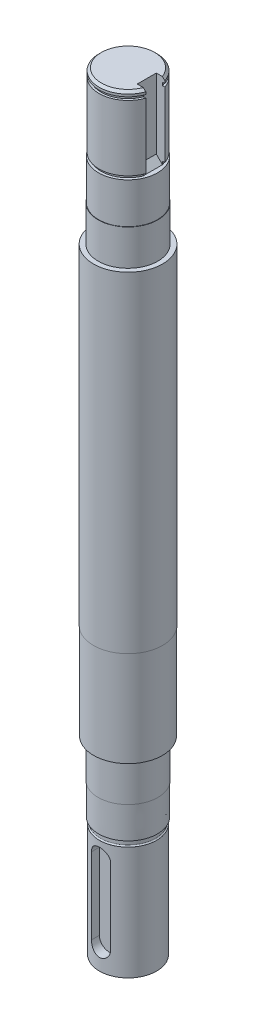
ISO-10303-21;
HEADER;
FILE_DESCRIPTION(('STEP AP214'),'2;1');
FILE_NAME('part.step','',(''),(''),'','','');
FILE_SCHEMA(('AUTOMOTIVE_DESIGN { 1 0 10303 214 1 1 1 1 }'));
ENDSEC;
DATA;
#1=APPLICATION_CONTEXT('core data for automotive mechanical design processes');
#2=APPLICATION_PROTOCOL_DEFINITION('international standard','automotive_design',2000,#1);
#3=PRODUCT_CONTEXT('',#1,'mechanical');
#4=PRODUCT('Part','Part','',(#3));
#5=PRODUCT_RELATED_PRODUCT_CATEGORY('part','',(#4));
#6=PRODUCT_DEFINITION_FORMATION('','',#4);
#7=PRODUCT_DEFINITION_CONTEXT('part definition',#1,'design');
#8=PRODUCT_DEFINITION('design','',#6,#7);
#9=PRODUCT_DEFINITION_SHAPE('','',#8);
#10=(LENGTH_UNIT() NAMED_UNIT(*) SI_UNIT(.MILLI.,.METRE.));
#11=(NAMED_UNIT(*) PLANE_ANGLE_UNIT() SI_UNIT($,.RADIAN.));
#12=(NAMED_UNIT(*) SI_UNIT($,.STERADIAN.) SOLID_ANGLE_UNIT());
#13=UNCERTAINTY_MEASURE_WITH_UNIT(LENGTH_MEASURE(1.E-05),#10,'distance_accuracy_value','');
#14=(GEOMETRIC_REPRESENTATION_CONTEXT(3) GLOBAL_UNCERTAINTY_ASSIGNED_CONTEXT((#13)) GLOBAL_UNIT_ASSIGNED_CONTEXT((#10,
#11,#12)) REPRESENTATION_CONTEXT('',''));
#15=CARTESIAN_POINT('',(0.,0.,0.));
#16=DIRECTION('',(0.,0.,1.));
#17=DIRECTION('',(1.,0.,0.));
#18=AXIS2_PLACEMENT_3D('',#15,#16,#17);
#19=CARTESIAN_POINT('',(12.,50.,0.));
#20=DIRECTION('',(0.,-1.,0.));
#21=DIRECTION('',(0.,0.,-1.));
#22=AXIS2_PLACEMENT_3D('',#19,#20,#21);
#23=PLANE('',#22);
#24=CARTESIAN_POINT('',(0.,50.,0.));
#25=DIRECTION('',(0.,-1.,0.));
#26=DIRECTION('',(0.,0.,-1.));
#27=AXIS2_PLACEMENT_3D('',#24,#25,#26);
#28=CIRCLE('',#27,12.35);
#29=CARTESIAN_POINT('',(0.,50.,-12.35));
#30=VERTEX_POINT('',#29);
#31=EDGE_CURVE('E295',#30,#30,#28,.T.);
#32=ORIENTED_EDGE('',*,*,#31,.T.);
#33=EDGE_LOOP('',(#32));
#34=FACE_BOUND('',#33,.T.);
#35=CARTESIAN_POINT('',(0.,50.,0.));
#36=DIRECTION('',(0.,-1.,0.));
#37=DIRECTION('',(0.,0.,-1.));
#38=AXIS2_PLACEMENT_3D('',#35,#36,#37);
#39=CIRCLE('',#38,11.99);
#40=CARTESIAN_POINT('',(0.,50.,-11.99));
#41=VERTEX_POINT('',#40);
#42=EDGE_CURVE('E219',#41,#41,#39,.T.);
#43=ORIENTED_EDGE('',*,*,#42,.F.);
#44=EDGE_LOOP('',(#43));
#45=FACE_BOUND('',#44,.T.);
#46=ADVANCED_FACE('F33',(#34,#45),#23,.T.);
#47=CARTESIAN_POINT('',(0.,50.,0.));
#48=DIRECTION('',(0.,-1.,0.));
#49=DIRECTION('',(0.,0.,-1.));
#50=AXIS2_PLACEMENT_3D('',#47,#48,#49);
#51=CONICAL_SURFACE('',#50,12.35,0.000548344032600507);
#52=CARTESIAN_POINT('',(0.,63.3,0.));
#53=DIRECTION('',(0.,-1.,0.));
#54=DIRECTION('',(0.,0.,-1.));
#55=AXIS2_PLACEMENT_3D('',#52,#53,#54);
#56=CIRCLE('',#55,12.3427070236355);
#57=CARTESIAN_POINT('',(0.,63.3,-12.3427070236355));
#58=VERTEX_POINT('',#57);
#59=EDGE_CURVE('E292',#58,#58,#56,.T.);
#60=ORIENTED_EDGE('',*,*,#59,.T.);
#61=EDGE_LOOP('',(#60));
#62=FACE_BOUND('',#61,.T.);
#63=ORIENTED_EDGE('',*,*,#31,.F.);
#64=EDGE_LOOP('',(#63));
#65=FACE_BOUND('',#64,.T.);
#66=ADVANCED_FACE('F376',(#62,#65),#51,.T.);
#67=CARTESIAN_POINT('',(12.5,63.3,0.));
#68=DIRECTION('',(0.,-1.,0.));
#69=DIRECTION('',(0.,0.,-1.));
#70=AXIS2_PLACEMENT_3D('',#67,#68,#69);
#71=PLANE('',#70);
#72=CARTESIAN_POINT('',(0.,63.3,0.));
#73=DIRECTION('',(0.,-1.,0.));
#74=DIRECTION('',(0.,0.,-1.));
#75=AXIS2_PLACEMENT_3D('',#72,#73,#74);
#76=CIRCLE('',#75,12.5);
#77=CARTESIAN_POINT('',(0.,63.3,-12.5));
#78=VERTEX_POINT('',#77);
#79=EDGE_CURVE('E289',#78,#78,#76,.T.);
#80=ORIENTED_EDGE('',*,*,#79,.T.);
#81=EDGE_LOOP('',(#80));
#82=FACE_BOUND('',#81,.T.);
#83=ORIENTED_EDGE('',*,*,#59,.F.);
#84=EDGE_LOOP('',(#83));
#85=FACE_BOUND('',#84,.T.);
#86=ADVANCED_FACE('F381',(#82,#85),#71,.T.);
#87=CARTESIAN_POINT('',(0.,326.056951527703,0.));
#88=DIRECTION('',(0.,-1.,0.));
#89=DIRECTION('',(0.,0.,-1.));
#90=AXIS2_PLACEMENT_3D('',#87,#88,#89);
#91=CYLINDRICAL_SURFACE('',#90,12.5);
#92=CARTESIAN_POINT('',(0.,79.5,0.));
#93=DIRECTION('',(0.,-1.,0.));
#94=DIRECTION('',(0.,0.,-1.));
#95=AXIS2_PLACEMENT_3D('',#92,#93,#94);
#96=CIRCLE('',#95,12.5);
#97=CARTESIAN_POINT('',(0.,79.5,-12.5));
#98=VERTEX_POINT('',#97);
#99=EDGE_CURVE('E286',#98,#98,#96,.T.);
#100=ORIENTED_EDGE('',*,*,#99,.T.);
#101=EDGE_LOOP('',(#100));
#102=FACE_BOUND('',#101,.T.);
#103=ORIENTED_EDGE('',*,*,#79,.F.);
#104=EDGE_LOOP('',(#103));
#105=FACE_BOUND('',#104,.T.);
#106=ADVANCED_FACE('F388',(#102,#105),#91,.T.);
#107=CARTESIAN_POINT('',(12.5,79.5,0.));
#108=DIRECTION('',(0.,-1.,0.));
#109=DIRECTION('',(0.,0.,-1.));
#110=AXIS2_PLACEMENT_3D('',#107,#108,#109);
#111=PLANE('',#110);
#112=CARTESIAN_POINT('',(0.,79.5,0.));
#113=DIRECTION('',(0.,-1.,0.));
#114=DIRECTION('',(0.,0.,-1.));
#115=AXIS2_PLACEMENT_3D('',#112,#113,#114);
#116=CIRCLE('',#115,14.4);
#117=CARTESIAN_POINT('',(0.,79.5,-14.4));
#118=VERTEX_POINT('',#117);
#119=EDGE_CURVE('E283',#118,#118,#116,.T.);
#120=ORIENTED_EDGE('',*,*,#119,.T.);
#121=EDGE_LOOP('',(#120));
#122=FACE_BOUND('',#121,.T.);
#123=ORIENTED_EDGE('',*,*,#99,.F.);
#124=EDGE_LOOP('',(#123));
#125=FACE_BOUND('',#124,.T.);
#126=ADVANCED_FACE('F392',(#122,#125),#111,.T.);
#127=CARTESIAN_POINT('',(0.,326.056951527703,0.));
#128=DIRECTION('',(0.,-1.,0.));
#129=DIRECTION('',(0.,0.,-1.));
#130=AXIS2_PLACEMENT_3D('',#127,#128,#129);
#131=CYLINDRICAL_SURFACE('',#130,14.4);
#132=CARTESIAN_POINT('',(0.,119.5,0.));
#133=DIRECTION('',(0.,-1.,0.));
#134=DIRECTION('',(0.,0.,-1.));
#135=AXIS2_PLACEMENT_3D('',#132,#133,#134);
#136=CIRCLE('',#135,14.4);
#137=CARTESIAN_POINT('',(0.,119.5,-14.4));
#138=VERTEX_POINT('',#137);
#139=EDGE_CURVE('E280',#138,#138,#136,.T.);
#140=ORIENTED_EDGE('',*,*,#139,.T.);
#141=EDGE_LOOP('',(#140));
#142=FACE_BOUND('',#141,.T.);
#143=ORIENTED_EDGE('',*,*,#119,.F.);
#144=EDGE_LOOP('',(#143));
#145=FACE_BOUND('',#144,.T.);
#146=ADVANCED_FACE('F396',(#142,#145),#131,.T.);
#147=CARTESIAN_POINT('',(14.5,119.5,0.));
#148=DIRECTION('',(0.,-1.,0.));
#149=DIRECTION('',(0.,0.,-1.));
#150=AXIS2_PLACEMENT_3D('',#147,#148,#149);
#151=PLANE('',#150);
#152=CARTESIAN_POINT('',(0.,119.5,0.));
#153=DIRECTION('',(0.,-1.,0.));
#154=DIRECTION('',(0.,0.,-1.));
#155=AXIS2_PLACEMENT_3D('',#152,#153,#154);
#156=CIRCLE('',#155,14.5);
#157=CARTESIAN_POINT('',(0.,119.5,-14.5));
#158=VERTEX_POINT('',#157);
#159=EDGE_CURVE('E277',#158,#158,#156,.T.);
#160=ORIENTED_EDGE('',*,*,#159,.T.);
#161=EDGE_LOOP('',(#160));
#162=FACE_BOUND('',#161,.T.);
#163=ORIENTED_EDGE('',*,*,#139,.F.);
#164=EDGE_LOOP('',(#163));
#165=FACE_BOUND('',#164,.T.);
#166=ADVANCED_FACE('F400',(#162,#165),#151,.T.);
#167=CARTESIAN_POINT('',(0.,326.056951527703,0.));
#168=DIRECTION('',(0.,-1.,0.));
#169=DIRECTION('',(0.,0.,-1.));
#170=AXIS2_PLACEMENT_3D('',#167,#168,#169);
#171=CYLINDRICAL_SURFACE('',#170,14.5);
#172=CARTESIAN_POINT('',(0.,258.,0.));
#173=DIRECTION('',(0.,-1.,0.));
#174=DIRECTION('',(0.,0.,-1.));
#175=AXIS2_PLACEMENT_3D('',#172,#173,#174);
#176=CIRCLE('',#175,14.5000000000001);
#177=CARTESIAN_POINT('',(0.,258.,-14.5000000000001));
#178=VERTEX_POINT('',#177);
#179=EDGE_CURVE('E274',#178,#178,#176,.T.);
#180=ORIENTED_EDGE('',*,*,#179,.T.);
#181=EDGE_LOOP('',(#180));
#182=FACE_BOUND('',#181,.T.);
#183=ORIENTED_EDGE('',*,*,#159,.F.);
#184=EDGE_LOOP('',(#183));
#185=FACE_BOUND('',#184,.T.);
#186=ADVANCED_FACE('F404',(#182,#185),#171,.T.);
#187=CARTESIAN_POINT('',(14.5000000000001,258.,0.));
#188=DIRECTION('',(0.,1.,0.));
#189=DIRECTION('',(0.,0.,1.));
#190=AXIS2_PLACEMENT_3D('',#187,#188,#189);
#191=PLANE('',#190);
#192=CARTESIAN_POINT('',(0.,258.,0.));
#193=DIRECTION('',(0.,-1.,0.));
#194=DIRECTION('',(0.,0.,-1.));
#195=AXIS2_PLACEMENT_3D('',#192,#193,#194);
#196=CIRCLE('',#195,12.5);
#197=CARTESIAN_POINT('',(0.,258.,-12.5));
#198=VERTEX_POINT('',#197);
#199=EDGE_CURVE('E271',#198,#198,#196,.T.);
#200=ORIENTED_EDGE('',*,*,#199,.T.);
#201=EDGE_LOOP('',(#200));
#202=FACE_BOUND('',#201,.T.);
#203=ORIENTED_EDGE('',*,*,#179,.F.);
#204=EDGE_LOOP('',(#203));
#205=FACE_BOUND('',#204,.T.);
#206=ADVANCED_FACE('F408',(#202,#205),#191,.T.);
#207=CARTESIAN_POINT('',(0.,326.056951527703,0.));
#208=DIRECTION('',(0.,-1.,0.));
#209=DIRECTION('',(0.,0.,-1.));
#210=AXIS2_PLACEMENT_3D('',#207,#208,#209);
#211=CYLINDRICAL_SURFACE('',#210,12.5);
#212=CARTESIAN_POINT('',(0.,273.,0.));
#213=DIRECTION('',(0.,-1.,0.));
#214=DIRECTION('',(0.,0.,-1.));
#215=AXIS2_PLACEMENT_3D('',#212,#213,#214);
#216=CIRCLE('',#215,12.5);
#217=CARTESIAN_POINT('',(0.,273.,-12.5));
#218=VERTEX_POINT('',#217);
#219=EDGE_CURVE('E268',#218,#218,#216,.T.);
#220=ORIENTED_EDGE('',*,*,#219,.T.);
#221=EDGE_LOOP('',(#220));
#222=FACE_BOUND('',#221,.T.);
#223=ORIENTED_EDGE('',*,*,#199,.F.);
#224=EDGE_LOOP('',(#223));
#225=FACE_BOUND('',#224,.T.);
#226=ADVANCED_FACE('F412',(#222,#225),#211,.T.);
#227=CARTESIAN_POINT('',(12.5,273.,0.));
#228=DIRECTION('',(0.,1.,0.));
#229=DIRECTION('',(0.,0.,1.));
#230=AXIS2_PLACEMENT_3D('',#227,#228,#229);
#231=PLANE('',#230);
#232=CARTESIAN_POINT('',(0.,273.,0.));
#233=DIRECTION('',(0.,-1.,0.));
#234=DIRECTION('',(0.,0.,-1.));
#235=AXIS2_PLACEMENT_3D('',#232,#233,#234);
#236=CIRCLE('',#235,12.35);
#237=CARTESIAN_POINT('',(0.,273.,-12.35));
#238=VERTEX_POINT('',#237);
#239=EDGE_CURVE('E265',#238,#238,#236,.T.);
#240=ORIENTED_EDGE('',*,*,#239,.T.);
#241=EDGE_LOOP('',(#240));
#242=FACE_BOUND('',#241,.T.);
#243=ORIENTED_EDGE('',*,*,#219,.F.);
#244=EDGE_LOOP('',(#243));
#245=FACE_BOUND('',#244,.T.);
#246=ADVANCED_FACE('F416',(#242,#245),#231,.T.);
#247=CARTESIAN_POINT('',(0.,326.056951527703,0.));
#248=DIRECTION('',(0.,-1.,0.));
#249=DIRECTION('',(0.,0.,-1.));
#250=AXIS2_PLACEMENT_3D('',#247,#248,#249);
#251=CYLINDRICAL_SURFACE('',#250,12.35);
#252=CARTESIAN_POINT('',(0.,290.,0.));
#253=DIRECTION('',(0.,-1.,0.));
#254=DIRECTION('',(0.,0.,-1.));
#255=AXIS2_PLACEMENT_3D('',#252,#253,#254);
#256=CIRCLE('',#255,12.35);
#257=CARTESIAN_POINT('',(0.,290.,-12.35));
#258=VERTEX_POINT('',#257);
#259=EDGE_CURVE('E262',#258,#258,#256,.T.);
#260=ORIENTED_EDGE('',*,*,#259,.T.);
#261=EDGE_LOOP('',(#260));
#262=FACE_BOUND('',#261,.T.);
#263=ORIENTED_EDGE('',*,*,#239,.F.);
#264=EDGE_LOOP('',(#263));
#265=FACE_BOUND('',#264,.T.);
#266=ADVANCED_FACE('F420',(#262,#265),#251,.T.);
#267=CARTESIAN_POINT('',(12.35,290.,0.));
#268=DIRECTION('',(0.,1.,0.));
#269=DIRECTION('',(0.,0.,1.));
#270=AXIS2_PLACEMENT_3D('',#267,#268,#269);
#271=PLANE('',#270);
#272=DIRECTION('',(1.,0.,0.));
#273=VECTOR('',#272,1.);
#274=CARTESIAN_POINT('',(7.85,290.,-4.));
#275=LINE('',#274,#273);
#276=CARTESIAN_POINT('',(10.45,290.,-4.));
#277=VERTEX_POINT('',#276);
#278=CARTESIAN_POINT('',(10.5226729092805,290.,-4.));
#279=VERTEX_POINT('',#278);
#280=EDGE_CURVE('E168',#277,#279,#275,.T.);
#281=ORIENTED_EDGE('',*,*,#280,.F.);
#282=DIRECTION('',(0.,0.,1.));
#283=VECTOR('',#282,1.);
#284=CARTESIAN_POINT('',(10.45,290.,4.));
#285=LINE('',#284,#283);
#286=CARTESIAN_POINT('',(10.45,290.,4.));
#287=VERTEX_POINT('',#286);
#288=EDGE_CURVE('E41',#277,#287,#285,.T.);
#289=ORIENTED_EDGE('',*,*,#288,.T.);
#290=DIRECTION('',(1.,0.,0.));
#291=VECTOR('',#290,1.);
#292=CARTESIAN_POINT('',(7.85,290.,4.));
#293=LINE('',#292,#291);
#294=CARTESIAN_POINT('',(10.5226729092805,290.,4.));
#295=VERTEX_POINT('',#294);
#296=EDGE_CURVE('E166',#287,#295,#293,.T.);
#297=ORIENTED_EDGE('',*,*,#296,.T.);
#298=CARTESIAN_POINT('',(0.,290.,0.));
#299=DIRECTION('',(0.,-1.,0.));
#300=DIRECTION('',(0.,0.,-1.));
#301=AXIS2_PLACEMENT_3D('',#298,#299,#300);
#302=CIRCLE('',#301,11.2572929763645);
#303=EDGE_CURVE('E259',#295,#279,#302,.T.);
#304=ORIENTED_EDGE('',*,*,#303,.T.);
#305=EDGE_LOOP('',(#281,#289,#297,#304));
#306=FACE_BOUND('',#305,.T.);
#307=ORIENTED_EDGE('',*,*,#259,.F.);
#308=EDGE_LOOP('',(#307));
#309=FACE_BOUND('',#308,.T.);
#310=ADVANCED_FACE('F424',(#306,#309),#271,.T.);
#311=CARTESIAN_POINT('',(0.,326.056951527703,0.));
#312=DIRECTION('',(0.,-1.,0.));
#313=DIRECTION('',(0.,0.,-1.));
#314=AXIS2_PLACEMENT_3D('',#311,#312,#313);
#315=CYLINDRICAL_SURFACE('',#314,11.2572929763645);
#316=DIRECTION('',(0.,-1.,0.));
#317=VECTOR('',#316,1.);
#318=CARTESIAN_POINT('',(10.5226729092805,326.056951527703,-4.));
#319=LINE('',#318,#317);
#320=CARTESIAN_POINT('',(10.5226729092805,291.3,-4.));
#321=VERTEX_POINT('',#320);
#322=EDGE_CURVE('E201',#279,#321,#319,.F.);
#323=ORIENTED_EDGE('',*,*,#322,.F.);
#324=ORIENTED_EDGE('',*,*,#303,.F.);
#325=DIRECTION('',(0.,-1.,0.));
#326=VECTOR('',#325,1.);
#327=CARTESIAN_POINT('',(10.5226729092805,326.056951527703,4.));
#328=LINE('',#327,#326);
#329=CARTESIAN_POINT('',(10.5226729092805,291.3,4.));
#330=VERTEX_POINT('',#329);
#331=EDGE_CURVE('E186',#330,#295,#328,.T.);
#332=ORIENTED_EDGE('',*,*,#331,.F.);
#333=CARTESIAN_POINT('',(0.,291.3,0.));
#334=DIRECTION('',(0.,-1.,0.));
#335=DIRECTION('',(0.,0.,-1.));
#336=AXIS2_PLACEMENT_3D('',#333,#334,#335);
#337=CIRCLE('',#336,11.2572929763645);
#338=EDGE_CURVE('E256',#330,#321,#337,.T.);
#339=ORIENTED_EDGE('',*,*,#338,.T.);
#340=EDGE_LOOP('',(#323,#324,#332,#339));
#341=FACE_BOUND('',#340,.T.);
#342=ADVANCED_FACE('F428',(#341),#315,.T.);
#343=CARTESIAN_POINT('',(11.2572929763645,291.3,0.));
#344=DIRECTION('',(0.,-1.,0.));
#345=DIRECTION('',(0.,0.,-1.));
#346=AXIS2_PLACEMENT_3D('',#343,#344,#345);
#347=PLANE('',#346);
#348=DIRECTION('',(1.,0.,0.));
#349=VECTOR('',#348,1.);
#350=CARTESIAN_POINT('',(11.2572929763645,291.3,-4.));
#351=LINE('',#350,#349);
#352=CARTESIAN_POINT('',(11.472684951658,291.3,-4.));
#353=VERTEX_POINT('',#352);
#354=EDGE_CURVE('E199',#321,#353,#351,.T.);
#355=ORIENTED_EDGE('',*,*,#354,.F.);
#356=ORIENTED_EDGE('',*,*,#338,.F.);
#357=DIRECTION('',(-1.,0.,0.));
#358=VECTOR('',#357,1.);
#359=CARTESIAN_POINT('',(11.2572929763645,291.3,4.));
#360=LINE('',#359,#358);
#361=CARTESIAN_POINT('',(11.472684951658,291.3,4.));
#362=VERTEX_POINT('',#361);
#363=EDGE_CURVE('E184',#362,#330,#360,.T.);
#364=ORIENTED_EDGE('',*,*,#363,.F.);
#365=CARTESIAN_POINT('',(0.,291.3,0.));
#366=DIRECTION('',(0.,-1.,0.));
#367=DIRECTION('',(0.,0.,-1.));
#368=AXIS2_PLACEMENT_3D('',#365,#366,#367);
#369=CIRCLE('',#368,12.15);
#370=EDGE_CURVE('E253',#362,#353,#369,.T.);
#371=ORIENTED_EDGE('',*,*,#370,.T.);
#372=EDGE_LOOP('',(#355,#356,#364,#371));
#373=FACE_BOUND('',#372,.T.);
#374=ADVANCED_FACE('F431',(#373),#347,.T.);
#375=CARTESIAN_POINT('',(0.,326.056951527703,0.));
#376=DIRECTION('',(0.,-1.,0.));
#377=DIRECTION('',(0.,0.,-1.));
#378=AXIS2_PLACEMENT_3D('',#375,#376,#377);
#379=CYLINDRICAL_SURFACE('',#378,12.15);
#380=DIRECTION('',(0.,-1.,0.));
#381=VECTOR('',#380,1.);
#382=CARTESIAN_POINT('',(11.472684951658,326.056951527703,-4.));
#383=LINE('',#382,#381);
#384=CARTESIAN_POINT('',(11.472684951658,318.7,-4.));
#385=VERTEX_POINT('',#384);
#386=EDGE_CURVE('E197',#353,#385,#383,.F.);
#387=ORIENTED_EDGE('',*,*,#386,.F.);
#388=ORIENTED_EDGE('',*,*,#370,.F.);
#389=DIRECTION('',(0.,-1.,0.));
#390=VECTOR('',#389,1.);
#391=CARTESIAN_POINT('',(11.472684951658,326.056951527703,4.));
#392=LINE('',#391,#390);
#393=CARTESIAN_POINT('',(11.472684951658,318.7,4.));
#394=VERTEX_POINT('',#393);
#395=EDGE_CURVE('E182',#394,#362,#392,.T.);
#396=ORIENTED_EDGE('',*,*,#395,.F.);
#397=CARTESIAN_POINT('',(0.,318.7,0.));
#398=DIRECTION('',(0.,-1.,0.));
#399=DIRECTION('',(0.,0.,-1.));
#400=AXIS2_PLACEMENT_3D('',#397,#398,#399);
#401=CIRCLE('',#400,12.15);
#402=EDGE_CURVE('E250',#394,#385,#401,.T.);
#403=ORIENTED_EDGE('',*,*,#402,.T.);
#404=EDGE_LOOP('',(#387,#388,#396,#403));
#405=FACE_BOUND('',#404,.T.);
#406=ADVANCED_FACE('F435',(#405),#379,.T.);
#407=CARTESIAN_POINT('',(11.25,318.7,0.));
#408=DIRECTION('',(0.,1.,0.));
#409=DIRECTION('',(0.,0.,1.));
#410=AXIS2_PLACEMENT_3D('',#407,#408,#409);
#411=PLANE('',#410);
#412=DIRECTION('',(-1.,0.,0.));
#413=VECTOR('',#412,1.);
#414=CARTESIAN_POINT('',(11.25,318.7,-4.));
#415=LINE('',#414,#413);
#416=CARTESIAN_POINT('',(10.5148704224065,318.7,-4.));
#417=VERTEX_POINT('',#416);
#418=EDGE_CURVE('E195',#385,#417,#415,.T.);
#419=ORIENTED_EDGE('',*,*,#418,.F.);
#420=ORIENTED_EDGE('',*,*,#402,.F.);
#421=DIRECTION('',(1.,0.,0.));
#422=VECTOR('',#421,1.);
#423=CARTESIAN_POINT('',(11.25,318.7,4.));
#424=LINE('',#423,#422);
#425=CARTESIAN_POINT('',(10.5148704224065,318.7,4.));
#426=VERTEX_POINT('',#425);
#427=EDGE_CURVE('E180',#426,#394,#424,.T.);
#428=ORIENTED_EDGE('',*,*,#427,.F.);
#429=CARTESIAN_POINT('',(0.,318.7,0.));
#430=DIRECTION('',(0.,-1.,0.));
#431=DIRECTION('',(0.,0.,-1.));
#432=AXIS2_PLACEMENT_3D('',#429,#430,#431);
#433=CIRCLE('',#432,11.25);
#434=EDGE_CURVE('E247',#426,#417,#433,.T.);
#435=ORIENTED_EDGE('',*,*,#434,.T.);
#436=EDGE_LOOP('',(#419,#420,#428,#435));
#437=FACE_BOUND('',#436,.T.);
#438=ADVANCED_FACE('F439',(#437),#411,.T.);
#439=CARTESIAN_POINT('',(0.,326.056951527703,0.));
#440=DIRECTION('',(0.,-1.,0.));
#441=DIRECTION('',(0.,0.,-1.));
#442=AXIS2_PLACEMENT_3D('',#439,#440,#441);
#443=CYLINDRICAL_SURFACE('',#442,11.25);
#444=DIRECTION('',(0.,-1.,0.));
#445=VECTOR('',#444,1.);
#446=CARTESIAN_POINT('',(10.5148704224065,326.056951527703,-4.));
#447=LINE('',#446,#445);
#448=CARTESIAN_POINT('',(10.5148704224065,320.,-4.));
#449=VERTEX_POINT('',#448);
#450=EDGE_CURVE('E193',#417,#449,#447,.F.);
#451=ORIENTED_EDGE('',*,*,#450,.F.);
#452=ORIENTED_EDGE('',*,*,#434,.F.);
#453=DIRECTION('',(0.,-1.,0.));
#454=VECTOR('',#453,1.);
#455=CARTESIAN_POINT('',(10.5148704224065,326.056951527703,4.));
#456=LINE('',#455,#454);
#457=CARTESIAN_POINT('',(10.5148704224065,320.,4.));
#458=VERTEX_POINT('',#457);
#459=EDGE_CURVE('E178',#458,#426,#456,.T.);
#460=ORIENTED_EDGE('',*,*,#459,.F.);
#461=CARTESIAN_POINT('',(0.,320.,0.));
#462=DIRECTION('',(0.,-1.,0.));
#463=DIRECTION('',(0.,0.,-1.));
#464=AXIS2_PLACEMENT_3D('',#461,#462,#463);
#465=CIRCLE('',#464,11.25);
#466=EDGE_CURVE('E244',#458,#449,#465,.T.);
#467=ORIENTED_EDGE('',*,*,#466,.T.);
#468=EDGE_LOOP('',(#451,#452,#460,#467));
#469=FACE_BOUND('',#468,.T.);
#470=ADVANCED_FACE('F443',(#469),#443,.T.);
#471=CARTESIAN_POINT('',(12.15,320.,0.));
#472=DIRECTION('',(0.,-1.,0.));
#473=DIRECTION('',(0.,0.,-1.));
#474=AXIS2_PLACEMENT_3D('',#471,#472,#473);
#475=PLANE('',#474);
#476=DIRECTION('',(1.,0.,0.));
#477=VECTOR('',#476,1.);
#478=CARTESIAN_POINT('',(12.15,320.,-4.));
#479=LINE('',#478,#477);
#480=CARTESIAN_POINT('',(11.472684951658,320.,-4.));
#481=VERTEX_POINT('',#480);
#482=EDGE_CURVE('E191',#449,#481,#479,.T.);
#483=ORIENTED_EDGE('',*,*,#482,.F.);
#484=ORIENTED_EDGE('',*,*,#466,.F.);
#485=DIRECTION('',(-1.,0.,0.));
#486=VECTOR('',#485,1.);
#487=CARTESIAN_POINT('',(12.15,320.,4.));
#488=LINE('',#487,#486);
#489=CARTESIAN_POINT('',(11.472684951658,320.,4.));
#490=VERTEX_POINT('',#489);
#491=EDGE_CURVE('E175',#490,#458,#488,.T.);
#492=ORIENTED_EDGE('',*,*,#491,.F.);
#493=CARTESIAN_POINT('',(0.,320.,0.));
#494=DIRECTION('',(0.,-1.,0.));
#495=DIRECTION('',(0.,0.,-1.));
#496=AXIS2_PLACEMENT_3D('',#493,#494,#495);
#497=CIRCLE('',#496,12.15);
#498=EDGE_CURVE('E241',#490,#481,#497,.T.);
#499=ORIENTED_EDGE('',*,*,#498,.T.);
#500=EDGE_LOOP('',(#483,#484,#492,#499));
#501=FACE_BOUND('',#500,.T.);
#502=ADVANCED_FACE('F447',(#501),#475,.T.);
#503=CARTESIAN_POINT('',(0.,326.056951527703,0.));
#504=DIRECTION('',(0.,-1.,0.));
#505=DIRECTION('',(0.,0.,-1.));
#506=AXIS2_PLACEMENT_3D('',#503,#504,#505);
#507=CYLINDRICAL_SURFACE('',#506,12.15);
#508=DIRECTION('',(0.,-1.,0.));
#509=VECTOR('',#508,1.);
#510=CARTESIAN_POINT('',(11.472684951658,326.056951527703,-4.));
#511=LINE('',#510,#509);
#512=CARTESIAN_POINT('',(11.472684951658,321.,-4.));
#513=VERTEX_POINT('',#512);
#514=EDGE_CURVE('E189',#481,#513,#511,.F.);
#515=ORIENTED_EDGE('',*,*,#514,.F.);
#516=ORIENTED_EDGE('',*,*,#498,.F.);
#517=DIRECTION('',(0.,-1.,0.));
#518=VECTOR('',#517,1.);
#519=CARTESIAN_POINT('',(11.472684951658,326.056951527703,4.));
#520=LINE('',#519,#518);
#521=CARTESIAN_POINT('',(11.472684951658,321.,4.));
#522=VERTEX_POINT('',#521);
#523=EDGE_CURVE('E173',#522,#490,#520,.T.);
#524=ORIENTED_EDGE('',*,*,#523,.F.);
#525=CARTESIAN_POINT('',(0.,321.,0.));
#526=DIRECTION('',(0.,1.,0.));
#527=DIRECTION('',(0.,0.,1.));
#528=AXIS2_PLACEMENT_3D('',#525,#526,#527);
#529=CIRCLE('',#528,12.15);
#530=EDGE_CURVE('E301',#522,#513,#529,.F.);
#531=ORIENTED_EDGE('',*,*,#530,.T.);
#532=EDGE_LOOP('',(#515,#516,#524,#531));
#533=FACE_BOUND('',#532,.T.);
#534=ADVANCED_FACE('F451',(#533),#507,.T.);
#535=CARTESIAN_POINT('',(12.15,322.,0.));
#536=DIRECTION('',(0.,1.,0.));
#537=DIRECTION('',(0.,0.,1.));
#538=AXIS2_PLACEMENT_3D('',#535,#536,#537);
#539=PLANE('',#538);
#540=DIRECTION('',(1.,0.,0.));
#541=VECTOR('',#540,1.);
#542=CARTESIAN_POINT('',(7.85,322.,-4.));
#543=LINE('',#542,#541);
#544=CARTESIAN_POINT('',(7.85,322.,-4.));
#545=VERTEX_POINT('',#544);
#546=CARTESIAN_POINT('',(10.4078095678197,322.,-4.));
#547=VERTEX_POINT('',#546);
#548=EDGE_CURVE('E176',#545,#547,#543,.T.);
#549=ORIENTED_EDGE('',*,*,#548,.T.);
#550=CARTESIAN_POINT('',(0.,322.,0.));
#551=DIRECTION('',(0.,1.,0.));
#552=DIRECTION('',(0.,0.,1.));
#553=AXIS2_PLACEMENT_3D('',#550,#551,#552);
#554=CIRCLE('',#553,11.15);
#555=CARTESIAN_POINT('',(10.4078095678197,322.,4.));
#556=VERTEX_POINT('',#555);
#557=EDGE_CURVE('E165',#547,#556,#554,.T.);
#558=ORIENTED_EDGE('',*,*,#557,.T.);
#559=DIRECTION('',(1.,0.,0.));
#560=VECTOR('',#559,1.);
#561=CARTESIAN_POINT('',(7.85,322.,4.));
#562=LINE('',#561,#560);
#563=CARTESIAN_POINT('',(7.85,322.,4.));
#564=VERTEX_POINT('',#563);
#565=EDGE_CURVE('E147',#564,#556,#562,.T.);
#566=ORIENTED_EDGE('',*,*,#565,.F.);
#567=DIRECTION('',(0.,0.,1.));
#568=VECTOR('',#567,1.);
#569=CARTESIAN_POINT('',(7.85,322.,4.));
#570=LINE('',#569,#568);
#571=EDGE_CURVE('E154',#545,#564,#570,.T.);
#572=ORIENTED_EDGE('',*,*,#571,.F.);
#573=EDGE_LOOP('',(#549,#558,#566,#572));
#574=FACE_BOUND('',#573,.T.);
#575=ADVANCED_FACE('F163',(#574),#539,.T.);
#576=CARTESIAN_POINT('',(0.,321.,0.));
#577=DIRECTION('',(0.,-1.,0.));
#578=DIRECTION('',(0.,0.,-1.));
#579=AXIS2_PLACEMENT_3D('',#576,#577,#578);
#580=CONICAL_SURFACE('',#579,12.15,0.785398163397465);
#581=CARTESIAN_POINT('',(16.720062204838,315.958127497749,-4.));
#582=CARTESIAN_POINT('',(16.2239323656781,316.440582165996,-4.));
#583=CARTESIAN_POINT('',(15.727275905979,316.92249878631,-4.));
#584=CARTESIAN_POINT('',(14.7324625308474,317.88471369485,-4.));
#585=CARTESIAN_POINT('',(14.2343057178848,318.365012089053,-4.));
#586=CARTESIAN_POINT('',(13.236269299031,319.32323347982,-4.));
#587=CARTESIAN_POINT('',(12.7363908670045,319.801157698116,-4.));
#588=CARTESIAN_POINT('',(11.733810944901,320.75411902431,-4.));
#589=CARTESIAN_POINT('',(11.2311092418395,321.229155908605,-4.));
#590=CARTESIAN_POINT('',(10.4738218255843,321.938700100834,-4.));
#591=CARTESIAN_POINT('',(10.2207427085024,322.174815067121,-4.));
#592=CARTESIAN_POINT('',(9.71334660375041,322.645708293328,-4.));
#593=CARTESIAN_POINT('',(9.45902962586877,322.880486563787,-4.));
#594=CARTESIAN_POINT('',(8.94891205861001,323.34833217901,-4.));
#595=CARTESIAN_POINT('',(8.69311175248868,323.581399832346,-4.));
#596=CARTESIAN_POINT('',(8.1795805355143,324.045417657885,-4.));
#597=CARTESIAN_POINT('',(7.92184956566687,324.2763677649,-4.));
#598=CARTESIAN_POINT('',(7.40373040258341,324.735676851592,-4.));
#599=CARTESIAN_POINT('',(7.14334031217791,324.964033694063,-4.));
#600=CARTESIAN_POINT('',(6.61937633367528,325.417035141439,-4.));
#601=CARTESIAN_POINT('',(6.35580272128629,325.641680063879,-4.));
#602=CARTESIAN_POINT('',(5.95714867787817,325.974880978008,-4.));
#603=CARTESIAN_POINT('',(5.8236715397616,326.085355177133,-4.));
#604=CARTESIAN_POINT('',(5.55546367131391,326.304766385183,-4.));
#605=CARTESIAN_POINT('',(5.42073297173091,326.413703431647,-4.));
#606=CARTESIAN_POINT('',(5.14976483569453,326.629772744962,-4.));
#607=CARTESIAN_POINT('',(5.01352697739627,326.736904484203,-4.));
#608=CARTESIAN_POINT('',(4.73929378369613,326.948916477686,-4.));
#609=CARTESIAN_POINT('',(4.60129830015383,327.05379654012,-4.));
#610=CARTESIAN_POINT('',(4.4622911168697,327.15733431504,-4.));
#611=B_SPLINE_CURVE_WITH_KNOTS('',3,(#581,#582,#583,#584,#585,#586,#587,#588,#589,#590,#591,
#592,#593,#594,#595,#596,#597,#598,#599,#600,#601,#602,#603,#604,#605,#606,#607,#608,#609,#610),
.UNSPECIFIED.,.F.,.F.,(4,2,2,2,2,2,2,2,2,2,2,2,2,2,4),(0.,2.07609728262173,4.15205585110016,
6.22680399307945,8.3017108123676,9.34006831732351,10.3784176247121,11.4165747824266,
12.4547637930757,13.4937540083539,14.5326548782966,15.0524402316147,15.5722128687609,
16.0921348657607,16.6121009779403),.UNSPECIFIED.);
#612=EDGE_CURVE('E356',#513,#547,#611,.T.);
#613=ORIENTED_EDGE('',*,*,#612,.F.);
#614=ORIENTED_EDGE('',*,*,#530,.F.);
#615=CARTESIAN_POINT('',(4.4622911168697,327.15733431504,4.));
#616=CARTESIAN_POINT('',(4.58005525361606,327.069628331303,4.));
#617=CARTESIAN_POINT('',(4.69708938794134,326.980951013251,4.));
#618=CARTESIAN_POINT('',(4.92986603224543,326.801929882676,4.));
#619=CARTESIAN_POINT('',(5.04560861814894,326.711586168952,4.));
#620=CARTESIAN_POINT('',(5.27595889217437,326.529518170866,4.));
#621=CARTESIAN_POINT('',(5.39056682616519,326.437794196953,4.));
#622=CARTESIAN_POINT('',(5.61881468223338,326.253147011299,4.));
#623=CARTESIAN_POINT('',(5.73245458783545,326.160223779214,4.));
#624=CARTESIAN_POINT('',(6.07198795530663,325.880016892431,4.));
#625=CARTESIAN_POINT('',(6.29661620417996,325.691199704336,4.));
#626=CARTESIAN_POINT('',(6.7432629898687,325.310485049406,4.));
#627=CARTESIAN_POINT('',(6.96528135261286,325.118587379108,4.));
#628=CARTESIAN_POINT('',(7.40707587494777,324.732563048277,4.));
#629=CARTESIAN_POINT('',(7.62685358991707,324.538438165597,4.));
#630=CARTESIAN_POINT('',(8.0647387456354,324.148326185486,4.));
#631=CARTESIAN_POINT('',(8.28284622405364,323.952339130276,4.));
#632=CARTESIAN_POINT('',(8.71772960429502,323.558845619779,4.));
#633=CARTESIAN_POINT('',(8.93450535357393,323.36133899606,4.));
#634=CARTESIAN_POINT('',(9.36693981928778,322.965106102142,4.));
#635=CARTESIAN_POINT('',(9.58259853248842,322.766379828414,4.));
#636=CARTESIAN_POINT('',(9.87539718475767,322.495300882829,4.));
#637=CARTESIAN_POINT('',(9.95294288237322,322.423385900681,4.));
#638=CARTESIAN_POINT('',(10.1079187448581,322.279434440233,4.));
#639=CARTESIAN_POINT('',(10.1853489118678,322.207397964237,4.));
#640=CARTESIAN_POINT('',(10.4174886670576,321.991105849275,4.));
#641=CARTESIAN_POINT('',(10.5720370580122,321.84667720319,4.));
#642=CARTESIAN_POINT('',(11.2313161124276,321.228960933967,4.));
#643=CARTESIAN_POINT('',(11.734224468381,320.753727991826,4.));
#644=CARTESIAN_POINT('',(12.7372584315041,319.800331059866,4.));
#645=CARTESIAN_POINT('',(13.2373840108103,319.322167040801,4.));
#646=CARTESIAN_POINT('',(14.2354612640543,318.363898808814,4.));
#647=CARTESIAN_POINT('',(14.7334135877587,317.883795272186,4.));
#648=CARTESIAN_POINT('',(15.7277734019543,316.922016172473,4.));
#649=CARTESIAN_POINT('',(16.2241809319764,316.440340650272,4.));
#650=CARTESIAN_POINT('',(16.720062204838,315.958127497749,4.));
#651=B_SPLINE_CURVE_WITH_KNOTS('',3,(#615,#616,#617,#618,#619,#620,#621,#622,#623,#624,#625,
#626,#627,#628,#629,#630,#631,#632,#633,#634,#635,#636,#637,#638,#639,#640,#641,#642,#643,#644,
#645,#646,#647,#648,#649,#650),.UNSPECIFIED.,.F.,.F.,(4,2,2,2,2,2,2,2,2,2,2,2,2,2,2,2,2,4),(0.,
0.440494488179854,0.880962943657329,1.32133376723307,1.76171207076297,2.64200442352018,
3.5223551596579,4.40204627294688,5.28171748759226,6.16148765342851,7.04126036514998,
7.35853919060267,7.67581206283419,8.31040054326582,10.3861611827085,12.4619425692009,
14.5370537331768,16.6121113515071),.UNSPECIFIED.);
#652=EDGE_CURVE('E349',#556,#522,#651,.T.);
#653=ORIENTED_EDGE('',*,*,#652,.F.);
#654=ORIENTED_EDGE('',*,*,#557,.F.);
#655=EDGE_LOOP('',(#613,#614,#653,#654));
#656=FACE_BOUND('',#655,.T.);
#657=ADVANCED_FACE('F363',(#656),#580,.T.);
#658=CARTESIAN_POINT('',(12.,47.5,0.));
#659=DIRECTION('',(0.,-1.,0.));
#660=DIRECTION('',(0.,0.,-1.));
#661=AXIS2_PLACEMENT_3D('',#658,#659,#660);
#662=PLANE('',#661);
#663=CARTESIAN_POINT('',(0.,47.5,0.));
#664=DIRECTION('',(0.,-1.,0.));
#665=DIRECTION('',(0.,0.,-1.));
#666=AXIS2_PLACEMENT_3D('',#663,#664,#665);
#667=CIRCLE('',#666,12.);
#668=CARTESIAN_POINT('',(0.,47.5,-12.));
#669=VERTEX_POINT('',#668);
#670=EDGE_CURVE('E238',#669,#669,#667,.T.);
#671=ORIENTED_EDGE('',*,*,#670,.F.);
#672=EDGE_LOOP('',(#671));
#673=FACE_BOUND('',#672,.T.);
#674=CARTESIAN_POINT('',(0.,47.5,0.));
#675=DIRECTION('',(0.,-1.,0.));
#676=DIRECTION('',(0.,0.,-1.));
#677=AXIS2_PLACEMENT_3D('',#674,#675,#676);
#678=CIRCLE('',#677,11.99);
#679=CARTESIAN_POINT('',(0.,47.5,-11.99));
#680=VERTEX_POINT('',#679);
#681=EDGE_CURVE('E235',#680,#680,#678,.T.);
#682=ORIENTED_EDGE('',*,*,#681,.T.);
#683=EDGE_LOOP('',(#682));
#684=FACE_BOUND('',#683,.T.);
#685=ADVANCED_FACE('F458',(#673,#684),#662,.F.);
#686=CARTESIAN_POINT('',(0.,47.99,0.));
#687=DIRECTION('',(0.,-1.,0.));
#688=DIRECTION('',(0.,0.,-1.));
#689=AXIS2_PLACEMENT_3D('',#686,#687,#688);
#690=TOROIDAL_SURFACE('',#689,11.99,0.489999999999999);
#691=ORIENTED_EDGE('',*,*,#681,.F.);
#692=EDGE_LOOP('',(#691));
#693=FACE_BOUND('',#692,.T.);
#694=CARTESIAN_POINT('',(0.,47.99,0.));
#695=DIRECTION('',(0.,-1.,0.));
#696=DIRECTION('',(0.,0.,-1.));
#697=AXIS2_PLACEMENT_3D('',#694,#695,#696);
#698=CIRCLE('',#697,11.5);
#699=CARTESIAN_POINT('',(0.,47.99,-11.5));
#700=VERTEX_POINT('',#699);
#701=EDGE_CURVE('E232',#700,#700,#698,.T.);
#702=ORIENTED_EDGE('',*,*,#701,.T.);
#703=EDGE_LOOP('',(#702));
#704=FACE_BOUND('',#703,.T.);
#705=ADVANCED_FACE('F461',(#693,#704),#690,.F.);
#706=CARTESIAN_POINT('',(0.,0.,0.));
#707=DIRECTION('',(0.,-1.,0.));
#708=DIRECTION('',(0.,0.,-1.));
#709=AXIS2_PLACEMENT_3D('',#706,#707,#708);
#710=CYLINDRICAL_SURFACE('',#709,11.5);
#711=ORIENTED_EDGE('',*,*,#701,.F.);
#712=EDGE_LOOP('',(#711));
#713=FACE_BOUND('',#712,.T.);
#714=CARTESIAN_POINT('',(0.,49.51,0.));
#715=DIRECTION('',(0.,-1.,0.));
#716=DIRECTION('',(0.,0.,-1.));
#717=AXIS2_PLACEMENT_3D('',#714,#715,#716);
#718=CIRCLE('',#717,11.5);
#719=CARTESIAN_POINT('',(0.,49.51,-11.5));
#720=VERTEX_POINT('',#719);
#721=EDGE_CURVE('E229',#720,#720,#718,.T.);
#722=ORIENTED_EDGE('',*,*,#721,.T.);
#723=EDGE_LOOP('',(#722));
#724=FACE_BOUND('',#723,.T.);
#725=ADVANCED_FACE('F464',(#713,#724),#710,.T.);
#726=CARTESIAN_POINT('',(0.,49.51,0.));
#727=DIRECTION('',(0.,-1.,0.));
#728=DIRECTION('',(0.,0.,-1.));
#729=AXIS2_PLACEMENT_3D('',#726,#727,#728);
#730=TOROIDAL_SURFACE('',#729,11.99,0.489999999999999);
#731=ORIENTED_EDGE('',*,*,#721,.F.);
#732=EDGE_LOOP('',(#731));
#733=FACE_BOUND('',#732,.T.);
#734=ORIENTED_EDGE('',*,*,#42,.T.);
#735=EDGE_LOOP('',(#734));
#736=FACE_BOUND('',#735,.T.);
#737=ADVANCED_FACE('F337',(#733,#736),#730,.F.);
#738=CARTESIAN_POINT('',(0.,0.,0.));
#739=DIRECTION('',(0.,-1.,0.));
#740=DIRECTION('',(0.,0.,-1.));
#741=AXIS2_PLACEMENT_3D('',#738,#739,#740);
#742=PLANE('',#741);
#743=CARTESIAN_POINT('',(0.,0.,0.));
#744=DIRECTION('',(0.,-1.,0.));
#745=DIRECTION('',(0.,0.,-1.));
#746=AXIS2_PLACEMENT_3D('',#743,#744,#745);
#747=CIRCLE('',#746,12.);
#748=CARTESIAN_POINT('',(0.,0.,-12.));
#749=VERTEX_POINT('',#748);
#750=EDGE_CURVE('E298',#749,#749,#747,.T.);
#751=ORIENTED_EDGE('',*,*,#750,.T.);
#752=EDGE_LOOP('',(#751));
#753=FACE_BOUND('',#752,.T.);
#754=ADVANCED_FACE('F471',(#753),#742,.T.);
#755=CARTESIAN_POINT('',(0.,326.056951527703,0.));
#756=DIRECTION('',(0.,-1.,0.));
#757=DIRECTION('',(0.,0.,-1.));
#758=AXIS2_PLACEMENT_3D('',#755,#756,#757);
#759=CYLINDRICAL_SURFACE('',#758,12.);
#760=CARTESIAN_POINT('',(4.,41.,11.3137084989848));
#761=CARTESIAN_POINT('',(4.0000143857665,41.1091313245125,11.3136910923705));
#762=CARTESIAN_POINT('',(3.99553419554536,41.2182529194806,11.3152871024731));
#763=CARTESIAN_POINT('',(3.97769673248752,41.4356496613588,11.3215763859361));
#764=CARTESIAN_POINT('',(3.96434185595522,41.5439250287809,11.3262688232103));
#765=CARTESIAN_POINT('',(3.92891935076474,41.7585447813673,11.3386032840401));
#766=CARTESIAN_POINT('',(3.90687756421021,41.8648939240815,11.3462365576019));
#767=CARTESIAN_POINT('',(3.85430689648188,42.0752132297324,11.364201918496));
#768=CARTESIAN_POINT('',(3.82377770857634,42.1791833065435,11.3745341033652));
#769=CARTESIAN_POINT('',(3.71986482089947,42.4863385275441,11.4091190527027));
#770=CARTESIAN_POINT('',(3.63410266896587,42.685086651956,11.4369799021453));
#771=CARTESIAN_POINT('',(3.4322845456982,43.0654028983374,11.4991525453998));
#772=CARTESIAN_POINT('',(3.31620997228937,43.246960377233,11.5334682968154));
#773=CARTESIAN_POINT('',(3.05220793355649,43.5948686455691,11.6061789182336));
#774=CARTESIAN_POINT('',(2.90330055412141,43.7604562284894,11.6446750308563));
#775=CARTESIAN_POINT('',(2.57995313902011,44.0648273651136,11.7205540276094));
#776=CARTESIAN_POINT('',(2.40550856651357,44.203606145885,11.7579367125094));
#777=CARTESIAN_POINT('',(2.03041476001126,44.4539171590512,11.8285552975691));
#778=CARTESIAN_POINT('',(1.82920040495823,44.5646436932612,11.8616574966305));
#779=CARTESIAN_POINT('',(1.40971695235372,44.7503692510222,11.9187843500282));
#780=CARTESIAN_POINT('',(1.19145308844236,44.8253791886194,11.9428117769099));
#781=CARTESIAN_POINT('',(0.752117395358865,44.9349428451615,11.9783628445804));
#782=CARTESIAN_POINT('',(0.531407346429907,44.9708130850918,11.9902923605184));
#783=CARTESIAN_POINT('',(0.0867958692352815,45.0052651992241,12.0017443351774));
#784=CARTESIAN_POINT('',(-0.137104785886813,45.0038559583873,12.0012697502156));
#785=CARTESIAN_POINT('',(-0.572415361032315,44.9646229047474,11.9882415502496));
#786=CARTESIAN_POINT('',(-0.783970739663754,44.9282295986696,11.9761624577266));
#787=CARTESIAN_POINT('',(-1.19777632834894,44.8224270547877,11.9418784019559));
#788=CARTESIAN_POINT('',(-1.4000260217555,44.7530159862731,11.9196728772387));
#789=CARTESIAN_POINT('',(-1.79261022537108,44.5823150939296,11.8670267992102));
#790=CARTESIAN_POINT('',(-1.98275302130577,44.4806179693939,11.8364817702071));
#791=CARTESIAN_POINT('',(-2.34369935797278,44.2485580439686,11.7703352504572));
#792=CARTESIAN_POINT('',(-2.51449761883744,44.1181874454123,11.7347323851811));
#793=CARTESIAN_POINT('',(-2.84038544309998,43.8253242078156,11.6602518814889));
#794=CARTESIAN_POINT('',(-2.99435951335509,43.6616098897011,11.6212989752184));
#795=CARTESIAN_POINT('',(-3.27310303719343,43.3102019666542,11.5458957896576));
#796=CARTESIAN_POINT('',(-3.39786305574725,43.1225006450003,11.5094463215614));
#797=CARTESIAN_POINT('',(-3.56109757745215,42.8252870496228,11.4595759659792));
#798=CARTESIAN_POINT('',(-3.61182358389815,42.7227445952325,11.4436484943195));
#799=CARTESIAN_POINT('',(-3.70440095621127,42.5134350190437,11.4140167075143));
#800=CARTESIAN_POINT('',(-3.74625601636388,42.4066696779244,11.4003114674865));
#801=CARTESIAN_POINT('',(-3.82067426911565,42.1897829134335,11.3755873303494));
#802=CARTESIAN_POINT('',(-3.85324757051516,42.079665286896,11.3645655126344));
#803=CARTESIAN_POINT('',(-3.90883841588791,41.8568318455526,11.3455648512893));
#804=CARTESIAN_POINT('',(-3.93186032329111,41.7441172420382,11.3375846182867));
#805=CARTESIAN_POINT('',(-3.96661962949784,41.5263575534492,11.3254693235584));
#806=CARTESIAN_POINT('',(-3.97913375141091,41.4214504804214,11.3210705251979));
#807=CARTESIAN_POINT('',(-3.99582494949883,41.2110316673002,11.3151843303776));
#808=CARTESIAN_POINT('',(-4.00001278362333,41.1055208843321,11.3136931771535));
#809=CARTESIAN_POINT('',(-4.,41.,11.3137084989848));
#810=B_SPLINE_CURVE_WITH_KNOTS('',3,(#760,#761,#762,#763,#764,#765,#766,#767,#768,#769,#770,
#771,#772,#773,#774,#775,#776,#777,#778,#779,#780,#781,#782,#783,#784,#785,#786,#787,#788,#789,
#790,#791,#792,#793,#794,#795,#796,#797,#798,#799,#800,#801,#802,#803,#804,#805,#806,#807,#808,
#809),.UNSPECIFIED.,.F.,.F.,(4,2,2,2,2,2,2,2,2,2,2,2,2,2,2,2,2,2,2,2,2,2,2,2,4),(0.,
0.327273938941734,0.654459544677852,0.980679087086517,1.30691042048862,1.95841627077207,
2.61032287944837,3.28524582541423,3.96028882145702,4.65295094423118,5.34540127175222,
6.01376445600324,6.68196834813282,7.32396236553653,7.96599198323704,8.61646637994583,
9.26711789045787,9.94834778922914,10.6297973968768,10.9759539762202,11.3219661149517,
11.6675999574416,12.0130757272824,12.3299368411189,12.6463882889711),.UNSPECIFIED.);
#811=CARTESIAN_POINT('',(4.,41.,11.3137084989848));
#812=VERTEX_POINT('',#811);
#813=CARTESIAN_POINT('',(-4.,41.,11.3137084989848));
#814=VERTEX_POINT('',#813);
#815=EDGE_CURVE('E305',#812,#814,#810,.T.);
#816=ORIENTED_EDGE('',*,*,#815,.F.);
#817=DIRECTION('',(0.,-1.,0.));
#818=VECTOR('',#817,1.);
#819=CARTESIAN_POINT('',(4.,326.056951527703,11.3137084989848));
#820=LINE('',#819,#818);
#821=CARTESIAN_POINT('',(4.,9.,11.3137084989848));
#822=VERTEX_POINT('',#821);
#823=EDGE_CURVE('E346',#822,#812,#820,.F.);
#824=ORIENTED_EDGE('',*,*,#823,.F.);
#825=CARTESIAN_POINT('',(-4.,9.,11.3137084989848));
#826=CARTESIAN_POINT('',(-4.0000143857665,8.89086867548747,11.3136910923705));
#827=CARTESIAN_POINT('',(-3.99553419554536,8.78174708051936,11.3152871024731));
#828=CARTESIAN_POINT('',(-3.97769673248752,8.5643503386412,11.3215763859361));
#829=CARTESIAN_POINT('',(-3.96434185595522,8.45607497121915,11.3262688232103));
#830=CARTESIAN_POINT('',(-3.92891935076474,8.24145521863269,11.3386032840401));
#831=CARTESIAN_POINT('',(-3.90687756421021,8.13510607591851,11.3462365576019));
#832=CARTESIAN_POINT('',(-3.85430689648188,7.92478677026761,11.364201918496));
#833=CARTESIAN_POINT('',(-3.82377770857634,7.82081669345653,11.3745341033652));
#834=CARTESIAN_POINT('',(-3.71986482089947,7.5136614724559,11.4091190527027));
#835=CARTESIAN_POINT('',(-3.63410266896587,7.31491334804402,11.4369799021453));
#836=CARTESIAN_POINT('',(-3.4322845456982,6.9345971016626,11.4991525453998));
#837=CARTESIAN_POINT('',(-3.31620997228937,6.75303962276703,11.5334682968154));
#838=CARTESIAN_POINT('',(-3.05220793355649,6.40513135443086,11.6061789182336));
#839=CARTESIAN_POINT('',(-2.90330055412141,6.23954377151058,11.6446750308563));
#840=CARTESIAN_POINT('',(-2.57995313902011,5.9351726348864,11.7205540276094));
#841=CARTESIAN_POINT('',(-2.40550856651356,5.79639385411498,11.7579367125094));
#842=CARTESIAN_POINT('',(-2.03041476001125,5.54608284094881,11.8285552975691));
#843=CARTESIAN_POINT('',(-1.82920040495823,5.43535630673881,11.8616574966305));
#844=CARTESIAN_POINT('',(-1.40971695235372,5.24963074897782,11.9187843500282));
#845=CARTESIAN_POINT('',(-1.19145308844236,5.17462081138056,11.9428117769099));
#846=CARTESIAN_POINT('',(-0.752117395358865,5.06505715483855,11.9783628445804));
#847=CARTESIAN_POINT('',(-0.531407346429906,5.02918691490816,11.9902923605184));
#848=CARTESIAN_POINT('',(-0.086795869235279,4.99473480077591,12.0017443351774));
#849=CARTESIAN_POINT('',(0.137104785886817,4.99614404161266,12.0012697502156));
#850=CARTESIAN_POINT('',(0.57241536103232,5.03537709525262,11.9882415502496));
#851=CARTESIAN_POINT('',(0.783970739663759,5.07177040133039,11.9761624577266));
#852=CARTESIAN_POINT('',(1.19777632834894,5.1775729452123,11.9418784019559));
#853=CARTESIAN_POINT('',(1.4000260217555,5.24698401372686,11.9196728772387));
#854=CARTESIAN_POINT('',(1.79261022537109,5.41768490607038,11.8670267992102));
#855=CARTESIAN_POINT('',(1.98275302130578,5.51938203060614,11.8364817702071));
#856=CARTESIAN_POINT('',(2.34369935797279,5.7514419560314,11.7703352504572));
#857=CARTESIAN_POINT('',(2.51449761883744,5.88181255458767,11.7347323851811));
#858=CARTESIAN_POINT('',(2.84038544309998,6.17467579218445,11.6602518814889));
#859=CARTESIAN_POINT('',(2.99435951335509,6.33839011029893,11.6212989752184));
#860=CARTESIAN_POINT('',(3.27310303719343,6.68979803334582,11.5458957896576));
#861=CARTESIAN_POINT('',(3.39786305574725,6.87749935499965,11.5094463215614));
#862=CARTESIAN_POINT('',(3.56109757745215,7.17471295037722,11.4595759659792));
#863=CARTESIAN_POINT('',(3.61182358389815,7.27725540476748,11.4436484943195));
#864=CARTESIAN_POINT('',(3.70440095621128,7.48656498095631,11.4140167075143));
#865=CARTESIAN_POINT('',(3.74625601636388,7.5933303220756,11.4003114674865));
#866=CARTESIAN_POINT('',(3.82067426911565,7.81021708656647,11.3755873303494));
#867=CARTESIAN_POINT('',(3.85324757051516,7.92033471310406,11.3645655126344));
#868=CARTESIAN_POINT('',(3.90883841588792,8.14316815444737,11.3455648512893));
#869=CARTESIAN_POINT('',(3.93186032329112,8.25588275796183,11.3375846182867));
#870=CARTESIAN_POINT('',(3.96661962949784,8.47364244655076,11.3254693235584));
#871=CARTESIAN_POINT('',(3.97913375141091,8.57854951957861,11.3210705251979));
#872=CARTESIAN_POINT('',(3.99582494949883,8.78896833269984,11.3151843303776));
#873=CARTESIAN_POINT('',(4.00001278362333,8.89447911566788,11.3136931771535));
#874=CARTESIAN_POINT('',(4.,9.,11.3137084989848));
#875=B_SPLINE_CURVE_WITH_KNOTS('',3,(#825,#826,#827,#828,#829,#830,#831,#832,#833,#834,#835,
#836,#837,#838,#839,#840,#841,#842,#843,#844,#845,#846,#847,#848,#849,#850,#851,#852,#853,#854,
#855,#856,#857,#858,#859,#860,#861,#862,#863,#864,#865,#866,#867,#868,#869,#870,#871,#872,#873,
#874),.UNSPECIFIED.,.F.,.F.,(4,2,2,2,2,2,2,2,2,2,2,2,2,2,2,2,2,2,2,2,2,2,2,2,4),(0.,
0.327273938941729,0.654459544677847,0.980679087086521,1.30691042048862,1.95841627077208,
2.61032287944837,3.28524582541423,3.96028882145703,4.65295094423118,5.34540127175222,
6.01376445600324,6.68196834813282,7.32396236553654,7.96599198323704,8.61646637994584,
9.26711789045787,9.94834778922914,10.6297973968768,10.9759539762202,11.3219661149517,
11.6675999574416,12.0130757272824,12.3299368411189,12.6463882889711),.UNSPECIFIED.);
#876=CARTESIAN_POINT('',(-4.,9.,11.3137084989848));
#877=VERTEX_POINT('',#876);
#878=EDGE_CURVE('E339',#877,#822,#875,.T.);
#879=ORIENTED_EDGE('',*,*,#878,.F.);
#880=DIRECTION('',(0.,-1.,0.));
#881=VECTOR('',#880,1.);
#882=CARTESIAN_POINT('',(-4.,326.056951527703,11.3137084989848));
#883=LINE('',#882,#881);
#884=EDGE_CURVE('E313',#814,#877,#883,.T.);
#885=ORIENTED_EDGE('',*,*,#884,.F.);
#886=EDGE_LOOP('',(#816,#824,#879,#885));
#887=FACE_BOUND('',#886,.T.);
#888=ORIENTED_EDGE('',*,*,#670,.T.);
#889=EDGE_LOOP('',(#888));
#890=FACE_BOUND('',#889,.T.);
#891=ORIENTED_EDGE('',*,*,#750,.F.);
#892=EDGE_LOOP('',(#891));
#893=FACE_BOUND('',#892,.T.);
#894=ADVANCED_FACE('F315',(#887,#890,#893),#759,.T.);
#895=CARTESIAN_POINT('',(0.,9.,8.));
#896=DIRECTION('',(0.,0.,1.));
#897=DIRECTION('',(1.,0.,0.));
#898=AXIS2_PLACEMENT_3D('',#895,#896,#897);
#899=CYLINDRICAL_SURFACE('',#898,4.);
#900=DIRECTION('',(0.,0.,1.));
#901=VECTOR('',#900,1.);
#902=CARTESIAN_POINT('',(-4.,9.,8.));
#903=LINE('',#902,#901);
#904=CARTESIAN_POINT('',(-4.,9.,8.));
#905=VERTEX_POINT('',#904);
#906=EDGE_CURVE('E216',#905,#877,#903,.T.);
#907=ORIENTED_EDGE('',*,*,#906,.T.);
#908=ORIENTED_EDGE('',*,*,#878,.T.);
#909=DIRECTION('',(0.,0.,1.));
#910=VECTOR('',#909,1.);
#911=CARTESIAN_POINT('',(4.,9.,8.));
#912=LINE('',#911,#910);
#913=CARTESIAN_POINT('',(4.,9.,8.));
#914=VERTEX_POINT('',#913);
#915=EDGE_CURVE('E215',#914,#822,#912,.T.);
#916=ORIENTED_EDGE('',*,*,#915,.F.);
#917=CARTESIAN_POINT('',(0.,9.,8.));
#918=DIRECTION('',(0.,0.,1.));
#919=DIRECTION('',(1.,0.,0.));
#920=AXIS2_PLACEMENT_3D('',#917,#918,#919);
#921=CIRCLE('',#920,4.);
#922=EDGE_CURVE('E203',#905,#914,#921,.T.);
#923=ORIENTED_EDGE('',*,*,#922,.F.);
#924=EDGE_LOOP('',(#907,#908,#916,#923));
#925=FACE_BOUND('',#924,.T.);
#926=ADVANCED_FACE('F332',(#925),#899,.F.);
#927=CARTESIAN_POINT('',(-4.,9.,8.));
#928=DIRECTION('',(-1.,0.,0.));
#929=DIRECTION('',(0.,0.,1.));
#930=AXIS2_PLACEMENT_3D('',#927,#928,#929);
#931=PLANE('',#930);
#932=ORIENTED_EDGE('',*,*,#884,.T.);
#933=ORIENTED_EDGE('',*,*,#906,.F.);
#934=DIRECTION('',(0.,-1.,0.));
#935=VECTOR('',#934,1.);
#936=CARTESIAN_POINT('',(-4.,9.,8.));
#937=LINE('',#936,#935);
#938=CARTESIAN_POINT('',(-4.,41.,8.));
#939=VERTEX_POINT('',#938);
#940=EDGE_CURVE('E212',#939,#905,#937,.T.);
#941=ORIENTED_EDGE('',*,*,#940,.F.);
#942=DIRECTION('',(0.,0.,1.));
#943=VECTOR('',#942,1.);
#944=CARTESIAN_POINT('',(-4.,41.,8.));
#945=LINE('',#944,#943);
#946=EDGE_CURVE('E220',#939,#814,#945,.T.);
#947=ORIENTED_EDGE('',*,*,#946,.T.);
#948=EDGE_LOOP('',(#932,#933,#941,#947));
#949=FACE_BOUND('',#948,.T.);
#950=ADVANCED_FACE('F325',(#949),#931,.F.);
#951=CARTESIAN_POINT('',(0.,41.,8.));
#952=DIRECTION('',(0.,0.,1.));
#953=DIRECTION('',(1.,0.,0.));
#954=AXIS2_PLACEMENT_3D('',#951,#952,#953);
#955=CYLINDRICAL_SURFACE('',#954,4.);
#956=DIRECTION('',(0.,0.,1.));
#957=VECTOR('',#956,1.);
#958=CARTESIAN_POINT('',(4.,41.,8.));
#959=LINE('',#958,#957);
#960=CARTESIAN_POINT('',(4.,41.,8.));
#961=VERTEX_POINT('',#960);
#962=EDGE_CURVE('E223',#961,#812,#959,.T.);
#963=ORIENTED_EDGE('',*,*,#962,.T.);
#964=ORIENTED_EDGE('',*,*,#815,.T.);
#965=ORIENTED_EDGE('',*,*,#946,.F.);
#966=CARTESIAN_POINT('',(0.,41.,8.));
#967=DIRECTION('',(0.,0.,1.));
#968=DIRECTION('',(1.,0.,0.));
#969=AXIS2_PLACEMENT_3D('',#966,#967,#968);
#970=CIRCLE('',#969,4.);
#971=EDGE_CURVE('E209',#961,#939,#970,.T.);
#972=ORIENTED_EDGE('',*,*,#971,.F.);
#973=EDGE_LOOP('',(#963,#964,#965,#972));
#974=FACE_BOUND('',#973,.T.);
#975=ADVANCED_FACE('F319',(#974),#955,.F.);
#976=CARTESIAN_POINT('',(4.,9.,8.));
#977=DIRECTION('',(1.,0.,0.));
#978=DIRECTION('',(0.,0.,-1.));
#979=AXIS2_PLACEMENT_3D('',#976,#977,#978);
#980=PLANE('',#979);
#981=ORIENTED_EDGE('',*,*,#823,.T.);
#982=ORIENTED_EDGE('',*,*,#962,.F.);
#983=DIRECTION('',(0.,1.,0.));
#984=VECTOR('',#983,1.);
#985=CARTESIAN_POINT('',(4.,9.,8.));
#986=LINE('',#985,#984);
#987=EDGE_CURVE('E206',#914,#961,#986,.T.);
#988=ORIENTED_EDGE('',*,*,#987,.F.);
#989=ORIENTED_EDGE('',*,*,#915,.T.);
#990=EDGE_LOOP('',(#981,#982,#988,#989));
#991=FACE_BOUND('',#990,.T.);
#992=ADVANCED_FACE('F324',(#991),#980,.F.);
#993=CARTESIAN_POINT('',(0.,9.,8.));
#994=DIRECTION('',(0.,0.,1.));
#995=DIRECTION('',(1.,0.,0.));
#996=AXIS2_PLACEMENT_3D('',#993,#994,#995);
#997=PLANE('',#996);
#998=ORIENTED_EDGE('',*,*,#922,.T.);
#999=ORIENTED_EDGE('',*,*,#987,.T.);
#1000=ORIENTED_EDGE('',*,*,#971,.T.);
#1001=ORIENTED_EDGE('',*,*,#940,.T.);
#1002=EDGE_LOOP('',(#998,#999,#1000,#1001));
#1003=FACE_BOUND('',#1002,.T.);
#1004=ADVANCED_FACE('F330',(#1003),#997,.T.);
#1005=CARTESIAN_POINT('',(7.85,290.,-4.));
#1006=DIRECTION('',(0.,0.,-1.));
#1007=DIRECTION('',(-1.,0.,0.));
#1008=AXIS2_PLACEMENT_3D('',#1005,#1006,#1007);
#1009=PLANE('',#1008);
#1010=DIRECTION('',(0.,1.,0.));
#1011=VECTOR('',#1010,1.);
#1012=CARTESIAN_POINT('',(7.85,290.,-4.));
#1013=LINE('',#1012,#1011);
#1014=CARTESIAN_POINT('',(7.85,292.6,-4.));
#1015=VERTEX_POINT('',#1014);
#1016=EDGE_CURVE('E153',#1015,#545,#1013,.T.);
#1017=ORIENTED_EDGE('',*,*,#1016,.F.);
#1018=DIRECTION('',(-0.707106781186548,0.707106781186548,0.));
#1019=VECTOR('',#1018,1.);
#1020=CARTESIAN_POINT('',(7.85,292.6,-4.));
#1021=LINE('',#1020,#1019);
#1022=EDGE_CURVE('E55',#1015,#277,#1021,.F.);
#1023=ORIENTED_EDGE('',*,*,#1022,.T.);
#1024=ORIENTED_EDGE('',*,*,#280,.T.);
#1025=ORIENTED_EDGE('',*,*,#322,.T.);
#1026=ORIENTED_EDGE('',*,*,#354,.T.);
#1027=ORIENTED_EDGE('',*,*,#386,.T.);
#1028=ORIENTED_EDGE('',*,*,#418,.T.);
#1029=ORIENTED_EDGE('',*,*,#450,.T.);
#1030=ORIENTED_EDGE('',*,*,#482,.T.);
#1031=ORIENTED_EDGE('',*,*,#514,.T.);
#1032=ORIENTED_EDGE('',*,*,#612,.T.);
#1033=ORIENTED_EDGE('',*,*,#548,.F.);
#1034=EDGE_LOOP('',(#1017,#1023,#1024,#1025,#1026,#1027,#1028,#1029,#1030,#1031,#1032,#1033));
#1035=FACE_BOUND('',#1034,.T.);
#1036=ADVANCED_FACE('F367',(#1035),#1009,.F.);
#1037=CARTESIAN_POINT('',(7.85,290.,4.));
#1038=DIRECTION('',(0.,0.,1.));
#1039=DIRECTION('',(1.,0.,0.));
#1040=AXIS2_PLACEMENT_3D('',#1037,#1038,#1039);
#1041=PLANE('',#1040);
#1042=ORIENTED_EDGE('',*,*,#296,.F.);
#1043=DIRECTION('',(0.707106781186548,-0.707106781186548,0.));
#1044=VECTOR('',#1043,1.);
#1045=CARTESIAN_POINT('',(7.85,292.6,4.));
#1046=LINE('',#1045,#1044);
#1047=CARTESIAN_POINT('',(7.85,292.6,4.));
#1048=VERTEX_POINT('',#1047);
#1049=EDGE_CURVE('E11',#287,#1048,#1046,.F.);
#1050=ORIENTED_EDGE('',*,*,#1049,.T.);
#1051=DIRECTION('',(0.,-1.,0.));
#1052=VECTOR('',#1051,1.);
#1053=CARTESIAN_POINT('',(7.85,290.,4.));
#1054=LINE('',#1053,#1052);
#1055=EDGE_CURVE('E143',#564,#1048,#1054,.T.);
#1056=ORIENTED_EDGE('',*,*,#1055,.F.);
#1057=ORIENTED_EDGE('',*,*,#565,.T.);
#1058=ORIENTED_EDGE('',*,*,#652,.T.);
#1059=ORIENTED_EDGE('',*,*,#523,.T.);
#1060=ORIENTED_EDGE('',*,*,#491,.T.);
#1061=ORIENTED_EDGE('',*,*,#459,.T.);
#1062=ORIENTED_EDGE('',*,*,#427,.T.);
#1063=ORIENTED_EDGE('',*,*,#395,.T.);
#1064=ORIENTED_EDGE('',*,*,#363,.T.);
#1065=ORIENTED_EDGE('',*,*,#331,.T.);
#1066=EDGE_LOOP('',(#1042,#1050,#1056,#1057,#1058,#1059,#1060,#1061,#1062,#1063,#1064,#1065));
#1067=FACE_BOUND('',#1066,.T.);
#1068=ADVANCED_FACE('F145',(#1067),#1041,.F.);
#1069=CARTESIAN_POINT('',(7.85,0.,0.));
#1070=DIRECTION('',(1.,0.,0.));
#1071=DIRECTION('',(0.,0.,-1.));
#1072=AXIS2_PLACEMENT_3D('',#1069,#1070,#1071);
#1073=PLANE('',#1072);
#1074=ORIENTED_EDGE('',*,*,#1055,.T.);
#1075=DIRECTION('',(0.,0.,-1.));
#1076=VECTOR('',#1075,1.);
#1077=CARTESIAN_POINT('',(7.85,292.6,-4.));
#1078=LINE('',#1077,#1076);
#1079=EDGE_CURVE('E622',#1048,#1015,#1078,.T.);
#1080=ORIENTED_EDGE('',*,*,#1079,.T.);
#1081=ORIENTED_EDGE('',*,*,#1016,.T.);
#1082=ORIENTED_EDGE('',*,*,#571,.T.);
#1083=EDGE_LOOP('',(#1074,#1080,#1081,#1082));
#1084=FACE_BOUND('',#1083,.T.);
#1085=ADVANCED_FACE('F157',(#1084),#1073,.T.);
#1086=CARTESIAN_POINT('',(7.85,292.6,0.));
#1087=DIRECTION('',(0.707106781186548,0.707106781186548,0.));
#1088=DIRECTION('',(0.,0.,1.));
#1089=AXIS2_PLACEMENT_3D('',#1086,#1087,#1088);
#1090=PLANE('',#1089);
#1091=ORIENTED_EDGE('',*,*,#1049,.F.);
#1092=ORIENTED_EDGE('',*,*,#288,.F.);
#1093=ORIENTED_EDGE('',*,*,#1022,.F.);
#1094=ORIENTED_EDGE('',*,*,#1079,.F.);
#1095=EDGE_LOOP('',(#1091,#1092,#1093,#1094));
#1096=FACE_BOUND('',#1095,.T.);
#1097=ADVANCED_FACE('F35',(#1096),#1090,.T.);
#1098=CLOSED_SHELL('',(#46,#66,#86,#106,#126,#146,#166,#186,#206,#226,#246,#266,#310,#342,#374,
#406,#438,#470,#502,#534,#575,#657,#685,#705,#725,#737,#754,#894,#926,#950,#975,#992,#1004,
#1036,#1068,#1085,#1097));
#1099=MANIFOLD_SOLID_BREP('B2',#1098);
#1100=ADVANCED_BREP_SHAPE_REPRESENTATION('',(#18,#1099),#14);
#1101=SHAPE_DEFINITION_REPRESENTATION(#9,#1100);
ENDSEC;
END-ISO-10303-21;
